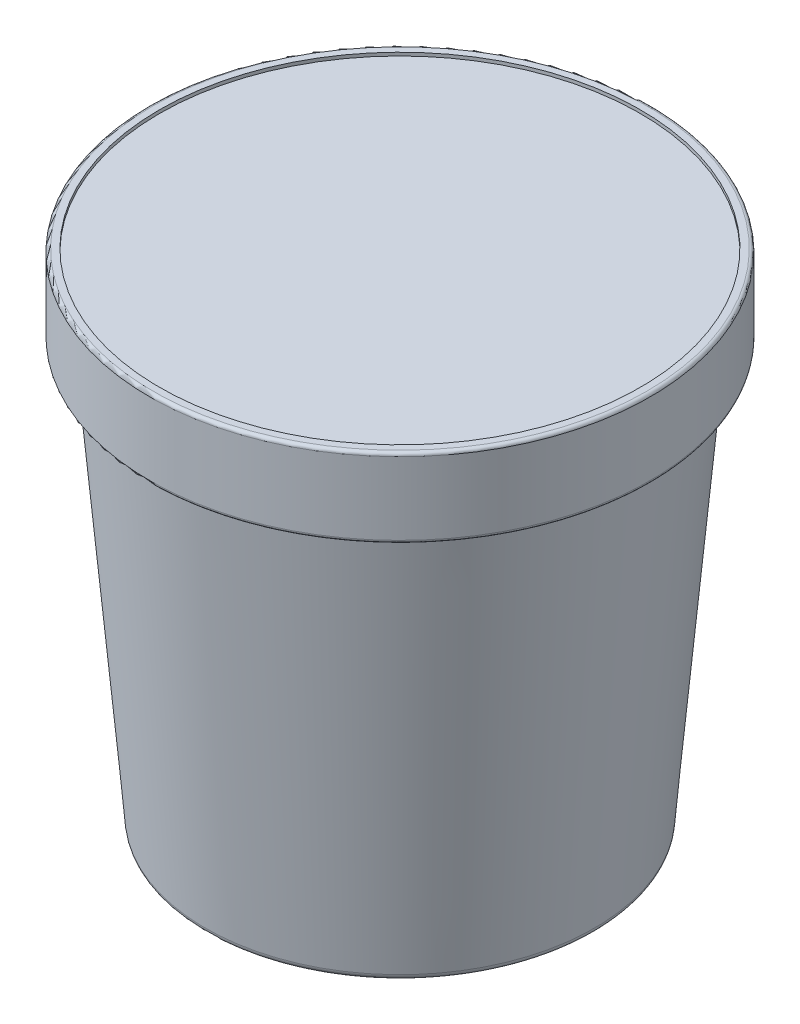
ISO-10303-21;
HEADER;
FILE_DESCRIPTION(('STEP AP214'),'2;1');
FILE_NAME('part.step','',(''),(''),'','','');
FILE_SCHEMA(('AUTOMOTIVE_DESIGN { 1 0 10303 214 1 1 1 1 }'));
ENDSEC;
DATA;
#1=APPLICATION_CONTEXT('core data for automotive mechanical design processes');
#2=APPLICATION_PROTOCOL_DEFINITION('international standard','automotive_design',2000,#1);
#3=PRODUCT_CONTEXT('',#1,'mechanical');
#4=PRODUCT('Part','Part','',(#3));
#5=PRODUCT_RELATED_PRODUCT_CATEGORY('part','',(#4));
#6=PRODUCT_DEFINITION_FORMATION('','',#4);
#7=PRODUCT_DEFINITION_CONTEXT('part definition',#1,'design');
#8=PRODUCT_DEFINITION('design','',#6,#7);
#9=PRODUCT_DEFINITION_SHAPE('','',#8);
#10=(LENGTH_UNIT() NAMED_UNIT(*) SI_UNIT(.MILLI.,.METRE.));
#11=(NAMED_UNIT(*) PLANE_ANGLE_UNIT() SI_UNIT($,.RADIAN.));
#12=(NAMED_UNIT(*) SI_UNIT($,.STERADIAN.) SOLID_ANGLE_UNIT());
#13=UNCERTAINTY_MEASURE_WITH_UNIT(LENGTH_MEASURE(1.E-05),#10,'distance_accuracy_value','');
#14=(GEOMETRIC_REPRESENTATION_CONTEXT(3) GLOBAL_UNCERTAINTY_ASSIGNED_CONTEXT((#13)) GLOBAL_UNIT_ASSIGNED_CONTEXT((#10,
#11,#12)) REPRESENTATION_CONTEXT('',''));
#15=CARTESIAN_POINT('',(0.,0.,0.));
#16=DIRECTION('',(0.,0.,1.));
#17=DIRECTION('',(1.,0.,0.));
#18=AXIS2_PLACEMENT_3D('',#15,#16,#17);
#19=CARTESIAN_POINT('',(36.5,75.,0.));
#20=DIRECTION('',(0.,-1.,0.));
#21=DIRECTION('',(1.,0.,0.));
#22=AXIS2_PLACEMENT_3D('',#19,#20,#21);
#23=PLANE('',#22);
#24=CARTESIAN_POINT('',(0.,75.,0.));
#25=DIRECTION('',(0.,1.,0.));
#26=DIRECTION('',(-1.,0.,0.));
#27=AXIS2_PLACEMENT_3D('',#24,#25,#26);
#28=CIRCLE('',#27,36.5);
#29=CARTESIAN_POINT('',(-36.5,75.,0.));
#30=VERTEX_POINT('',#29);
#31=EDGE_CURVE('E10',#30,#30,#28,.T.);
#32=ORIENTED_EDGE('',*,*,#31,.T.);
#33=EDGE_LOOP('',(#32));
#34=FACE_BOUND('',#33,.T.);
#35=ADVANCED_FACE('F32',(#34),#23,.F.);
#36=CARTESIAN_POINT('',(0.,75.,0.));
#37=DIRECTION('',(0.,1.,0.));
#38=DIRECTION('',(-1.,0.,0.));
#39=AXIS2_PLACEMENT_3D('',#36,#37,#38);
#40=CYLINDRICAL_SURFACE('',#39,36.5);
#41=ORIENTED_EDGE('',*,*,#31,.F.);
#42=EDGE_LOOP('',(#41));
#43=FACE_BOUND('',#42,.T.);
#44=CARTESIAN_POINT('',(0.,75.5,0.));
#45=DIRECTION('',(0.,1.,0.));
#46=DIRECTION('',(-1.,0.,0.));
#47=AXIS2_PLACEMENT_3D('',#44,#45,#46);
#48=CIRCLE('',#47,36.5);
#49=CARTESIAN_POINT('',(-36.5,75.5,0.));
#50=VERTEX_POINT('',#49);
#51=EDGE_CURVE('E38',#50,#50,#48,.T.);
#52=ORIENTED_EDGE('',*,*,#51,.T.);
#53=EDGE_LOOP('',(#52));
#54=FACE_BOUND('',#53,.T.);
#55=ADVANCED_FACE('F79',(#43,#54),#40,.F.);
#56=CARTESIAN_POINT('',(37.5,75.5,0.));
#57=DIRECTION('',(0.,-1.,0.));
#58=DIRECTION('',(1.,0.,0.));
#59=AXIS2_PLACEMENT_3D('',#56,#57,#58);
#60=PLANE('',#59);
#61=ORIENTED_EDGE('',*,*,#51,.F.);
#62=EDGE_LOOP('',(#61));
#63=FACE_BOUND('',#62,.T.);
#64=CARTESIAN_POINT('',(0.,75.5,0.));
#65=DIRECTION('',(0.,1.,0.));
#66=DIRECTION('',(-1.,0.,0.));
#67=AXIS2_PLACEMENT_3D('',#64,#65,#66);
#68=CIRCLE('',#67,37.5);
#69=CARTESIAN_POINT('',(-37.5,75.5,0.));
#70=VERTEX_POINT('',#69);
#71=EDGE_CURVE('E42',#70,#70,#68,.T.);
#72=ORIENTED_EDGE('',*,*,#71,.T.);
#73=EDGE_LOOP('',(#72));
#74=FACE_BOUND('',#73,.T.);
#75=ADVANCED_FACE('F83',(#63,#74),#60,.F.);
#76=CARTESIAN_POINT('',(0.,75.,0.));
#77=DIRECTION('',(0.,1.,0.));
#78=DIRECTION('',(-1.,0.,0.));
#79=AXIS2_PLACEMENT_3D('',#76,#77,#78);
#80=TOROIDAL_SURFACE('',#79,37.5,0.5);
#81=ORIENTED_EDGE('',*,*,#71,.F.);
#82=EDGE_LOOP('',(#81));
#83=FACE_BOUND('',#82,.T.);
#84=CARTESIAN_POINT('',(0.,75.,0.));
#85=DIRECTION('',(0.,1.,0.));
#86=DIRECTION('',(-1.,0.,0.));
#87=AXIS2_PLACEMENT_3D('',#84,#85,#86);
#88=CIRCLE('',#87,38.);
#89=CARTESIAN_POINT('',(-38.,75.,0.));
#90=VERTEX_POINT('',#89);
#91=EDGE_CURVE('E46',#90,#90,#88,.T.);
#92=ORIENTED_EDGE('',*,*,#91,.T.);
#93=EDGE_LOOP('',(#92));
#94=FACE_BOUND('',#93,.T.);
#95=ADVANCED_FACE('F88',(#83,#94),#80,.T.);
#96=CARTESIAN_POINT('',(0.,75.,0.));
#97=DIRECTION('',(0.,1.,0.));
#98=DIRECTION('',(-1.,0.,0.));
#99=AXIS2_PLACEMENT_3D('',#96,#97,#98);
#100=CYLINDRICAL_SURFACE('',#99,38.);
#101=ORIENTED_EDGE('',*,*,#91,.F.);
#102=EDGE_LOOP('',(#101));
#103=FACE_BOUND('',#102,.T.);
#104=CARTESIAN_POINT('',(0.,64.,0.));
#105=DIRECTION('',(0.,1.,0.));
#106=DIRECTION('',(-1.,0.,0.));
#107=AXIS2_PLACEMENT_3D('',#104,#105,#106);
#108=CIRCLE('',#107,38.);
#109=CARTESIAN_POINT('',(-38.,64.,0.));
#110=VERTEX_POINT('',#109);
#111=EDGE_CURVE('E51',#110,#110,#108,.T.);
#112=ORIENTED_EDGE('',*,*,#111,.T.);
#113=EDGE_LOOP('',(#112));
#114=FACE_BOUND('',#113,.T.);
#115=ADVANCED_FACE('F94',(#103,#114),#100,.T.);
#116=CARTESIAN_POINT('',(0.,64.,0.));
#117=DIRECTION('',(0.,1.,0.));
#118=DIRECTION('',(-1.,0.,0.));
#119=AXIS2_PLACEMENT_3D('',#116,#117,#118);
#120=TOROIDAL_SURFACE('',#119,37.5,0.5);
#121=ORIENTED_EDGE('',*,*,#111,.F.);
#122=EDGE_LOOP('',(#121));
#123=FACE_BOUND('',#122,.T.);
#124=CARTESIAN_POINT('',(0.,63.5,0.));
#125=DIRECTION('',(0.,1.,0.));
#126=DIRECTION('',(-1.,0.,0.));
#127=AXIS2_PLACEMENT_3D('',#124,#125,#126);
#128=CIRCLE('',#127,37.5);
#129=CARTESIAN_POINT('',(-37.5,63.5,0.));
#130=VERTEX_POINT('',#129);
#131=EDGE_CURVE('E54',#130,#130,#128,.T.);
#132=ORIENTED_EDGE('',*,*,#131,.T.);
#133=EDGE_LOOP('',(#132));
#134=FACE_BOUND('',#133,.T.);
#135=ADVANCED_FACE('F98',(#123,#134),#120,.T.);
#136=CARTESIAN_POINT('',(37.5,63.5,0.));
#137=DIRECTION('',(0.,1.,0.));
#138=DIRECTION('',(-1.,0.,0.));
#139=AXIS2_PLACEMENT_3D('',#136,#137,#138);
#140=PLANE('',#139);
#141=ORIENTED_EDGE('',*,*,#131,.F.);
#142=EDGE_LOOP('',(#141));
#143=FACE_BOUND('',#142,.T.);
#144=CARTESIAN_POINT('',(0.,63.5,0.));
#145=DIRECTION('',(0.,1.,0.));
#146=DIRECTION('',(-1.,0.,0.));
#147=AXIS2_PLACEMENT_3D('',#144,#145,#146);
#148=CIRCLE('',#147,35.);
#149=CARTESIAN_POINT('',(-35.,63.5,0.));
#150=VERTEX_POINT('',#149);
#151=EDGE_CURVE('E57',#150,#150,#148,.T.);
#152=ORIENTED_EDGE('',*,*,#151,.T.);
#153=EDGE_LOOP('',(#152));
#154=FACE_BOUND('',#153,.T.);
#155=ADVANCED_FACE('F102',(#143,#154),#140,.F.);
#156=CARTESIAN_POINT('',(0.,0.91284425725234,0.));
#157=DIRECTION('',(0.,1.,0.));
#158=DIRECTION('',(-1.,0.,0.));
#159=AXIS2_PLACEMENT_3D('',#156,#157,#158);
#160=CONICAL_SURFACE('',#159,29.5243333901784,0.0872664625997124);
#161=ORIENTED_EDGE('',*,*,#151,.F.);
#162=EDGE_LOOP('',(#161));
#163=FACE_BOUND('',#162,.T.);
#164=CARTESIAN_POINT('',(0.,0.91284425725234,0.));
#165=DIRECTION('',(0.,1.,0.));
#166=DIRECTION('',(-1.,0.,0.));
#167=AXIS2_PLACEMENT_3D('',#164,#165,#166);
#168=CIRCLE('',#167,29.5243333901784);
#169=CARTESIAN_POINT('',(-29.5243333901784,0.91284425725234,0.));
#170=VERTEX_POINT('',#169);
#171=EDGE_CURVE('E60',#170,#170,#168,.T.);
#172=ORIENTED_EDGE('',*,*,#171,.T.);
#173=EDGE_LOOP('',(#172));
#174=FACE_BOUND('',#173,.T.);
#175=ADVANCED_FACE('F75',(#163,#174),#160,.T.);
#176=CARTESIAN_POINT('',(0.,1.,0.));
#177=DIRECTION('',(0.,1.,0.));
#178=DIRECTION('',(-1.,0.,0.));
#179=AXIS2_PLACEMENT_3D('',#176,#177,#178);
#180=TOROIDAL_SURFACE('',#179,28.5281386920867,0.999999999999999);
#181=ORIENTED_EDGE('',*,*,#171,.F.);
#182=EDGE_LOOP('',(#181));
#183=FACE_BOUND('',#182,.T.);
#184=CARTESIAN_POINT('',(0.,0.,0.));
#185=DIRECTION('',(0.,1.,0.));
#186=DIRECTION('',(-1.,0.,0.));
#187=AXIS2_PLACEMENT_3D('',#184,#185,#186);
#188=CIRCLE('',#187,28.5281386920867);
#189=CARTESIAN_POINT('',(-28.5281386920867,0.,0.));
#190=VERTEX_POINT('',#189);
#191=EDGE_CURVE('E63',#190,#190,#188,.T.);
#192=ORIENTED_EDGE('',*,*,#191,.T.);
#193=EDGE_LOOP('',(#192));
#194=FACE_BOUND('',#193,.T.);
#195=ADVANCED_FACE('F67',(#183,#194),#180,.T.);
#196=CARTESIAN_POINT('',(28.5281386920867,0.,0.));
#197=DIRECTION('',(0.,1.,0.));
#198=DIRECTION('',(-1.,0.,0.));
#199=AXIS2_PLACEMENT_3D('',#196,#197,#198);
#200=PLANE('',#199);
#201=ORIENTED_EDGE('',*,*,#191,.F.);
#202=EDGE_LOOP('',(#201));
#203=FACE_BOUND('',#202,.T.);
#204=ADVANCED_FACE('F69',(#203),#200,.F.);
#205=CLOSED_SHELL('',(#35,#55,#75,#95,#115,#135,#155,#175,#195,#204));
#206=MANIFOLD_SOLID_BREP('B2',#205);
#207=ADVANCED_BREP_SHAPE_REPRESENTATION('',(#18,#206),#14);
#208=SHAPE_DEFINITION_REPRESENTATION(#9,#207);
ENDSEC;
END-ISO-10303-21;
